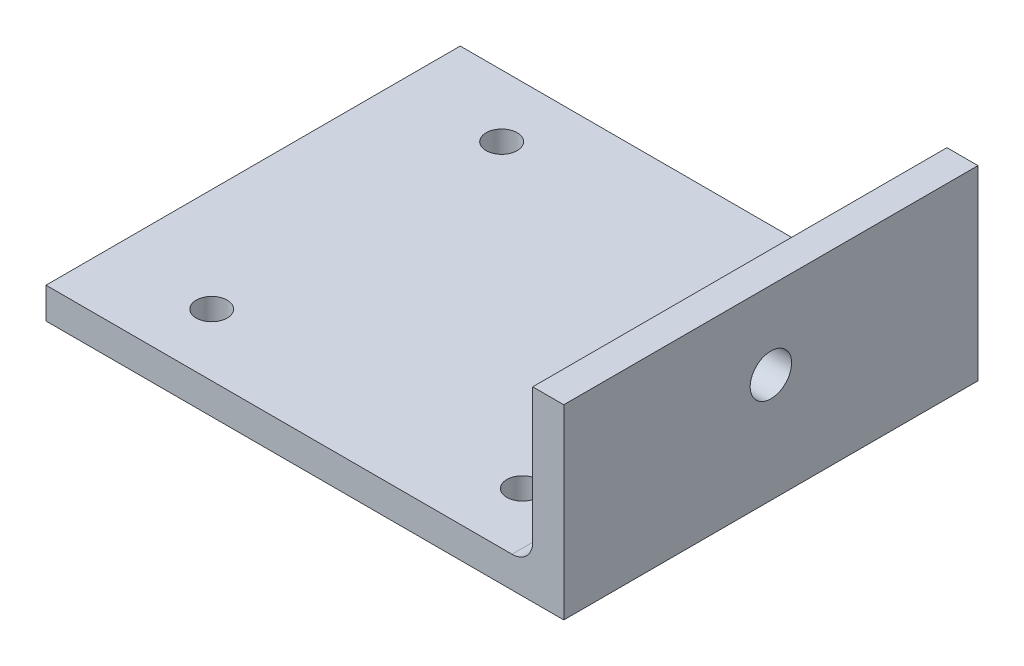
from build123d import *

# Parameters (mm, degrees)
ESQUISSE1_W             = 50
ESQUISSE1_H             = 40
ESQUISSE1_R             = 1.5
BOSS_EXTRU_1_DEPTH      = 3
ESQUISSE2_W             = 3
ESQUISSE2_H             = 40
BOSS_EXTRU_2_DEPTH      = 15
ENL_V_MAT_EXTRU_1_REACH = 59.539
ESQUISSE3_R             = 2
CONG_1_R                = 2


with BuildPart() as part:
    # Esquisse1 → Boss.-Extru.1 (new body)
    with BuildSketch(Plane(origin=(0, 0, 0), x_dir=(1, 0, 0), z_dir=(0, 1, 0))):
        with Locations((3.556701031, -2.06185567)):
            Rectangle(ESQUISSE1_W, ESQUISSE1_H)
        with Locations(Location((-11.443298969, -16.06185567, 0), (0, 0, 270))):
            Circle(ESQUISSE1_R, mode=Mode.SUBTRACT)
        with Locations(Location((18.556701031, -16.06185567, 0), (0, 0, 90))):
            Circle(ESQUISSE1_R, mode=Mode.SUBTRACT)
        with Locations(Location((18.556701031, 11.93814433, 0), (0, 0, 270))):
            Circle(ESQUISSE1_R, mode=Mode.SUBTRACT)
        with Locations(Location((-11.443298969, 11.93814433, 0), (0, 0, 90))):
            Circle(ESQUISSE1_R, mode=Mode.SUBTRACT)
    extrude(amount=BOSS_EXTRU_1_DEPTH)

    # Esquisse2 → Boss.-Extru.2 (add)
    with BuildSketch(Plane(origin=(0, 3, 0), x_dir=(1, 0, 0), z_dir=(0, 1, 0))):
        with Locations((27.056701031, -2.06185567)):
            Rectangle(ESQUISSE2_W, ESQUISSE2_H)
    extrude(amount=BOSS_EXTRU_2_DEPTH)

    # Esquisse3 → Enl_v. mat.-Extru.1 (cut, up to next)
    with BuildSketch(Plane(origin=(28.556701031, 0, 0), x_dir=(0, 0, -1), z_dir=(1, 0, 0)), mode=Mode.PRIVATE) as enl_v_mat_extru_1_sk1:
        with Locations((-2.06185567, 10.5)):
            Circle(ESQUISSE3_R)
    enl_v_mat_extru_1_tool1 = extrude(enl_v_mat_extru_1_sk1.sketch, amount=-ENL_V_MAT_EXTRU_1_REACH, mode=Mode.PRIVATE) & part.part
    add(enl_v_mat_extru_1_tool1.solids().sort_by_distance((28.556701, 10.5, 2.061856))[0], mode=Mode.SUBTRACT)

    # Cong_1
    cong_1_edges = [part.edges().sort_by_distance(p)[0] for p in [
        (25.556701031, 3, 2.06185567),
    ]]
    fillet(cong_1_edges, radius=CONG_1_R)


solid = part.part
